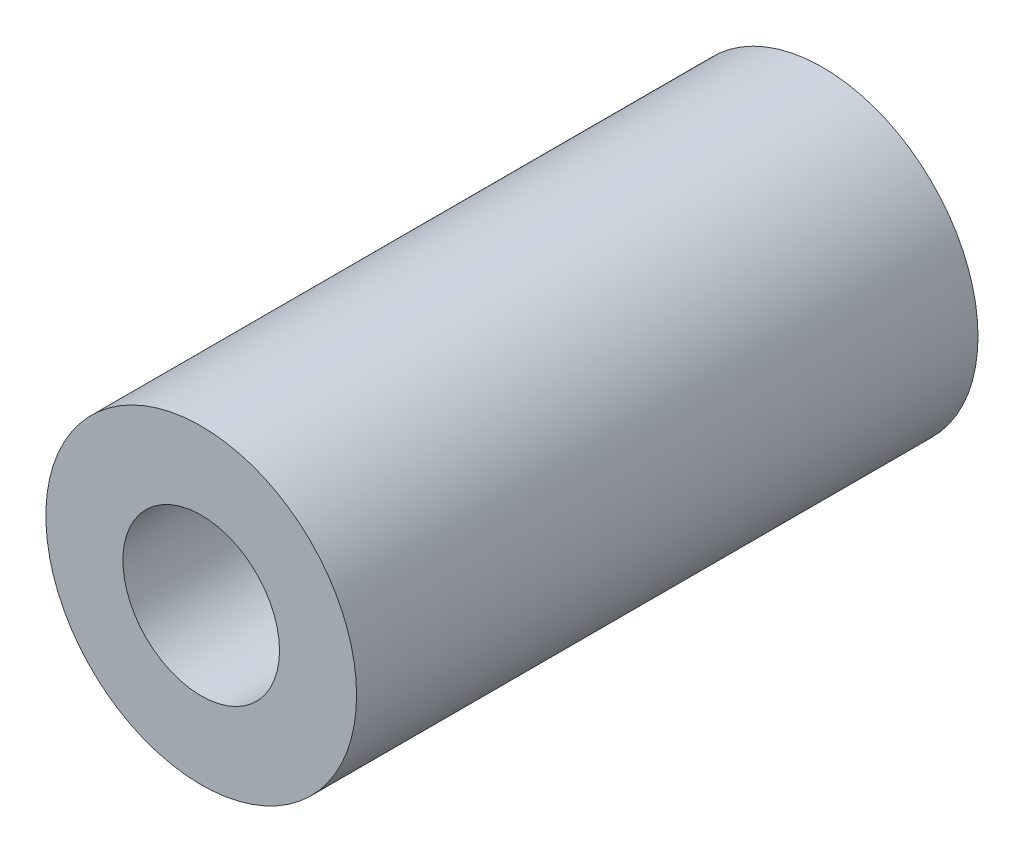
from build123d import *

# Parameters (mm, degrees)
EXTRUDE1_DEPTH      = 12.7
EXTRUDE1_DEPTH_BACK = 12.7
SKETCH1_R           = 6.35
SKETCH1_R_2         = 3.2004


with BuildPart() as part:
    # Sketch1 → Extrude1 (new, two sides: drawn at the far end of the back side and taken through both)
    with BuildSketch(Plane.XY.offset(-EXTRUDE1_DEPTH_BACK)):
        Circle(SKETCH1_R)
        Circle(SKETCH1_R_2, mode=Mode.SUBTRACT)
    extrude(amount=EXTRUDE1_DEPTH + EXTRUDE1_DEPTH_BACK)


solid = part.part
